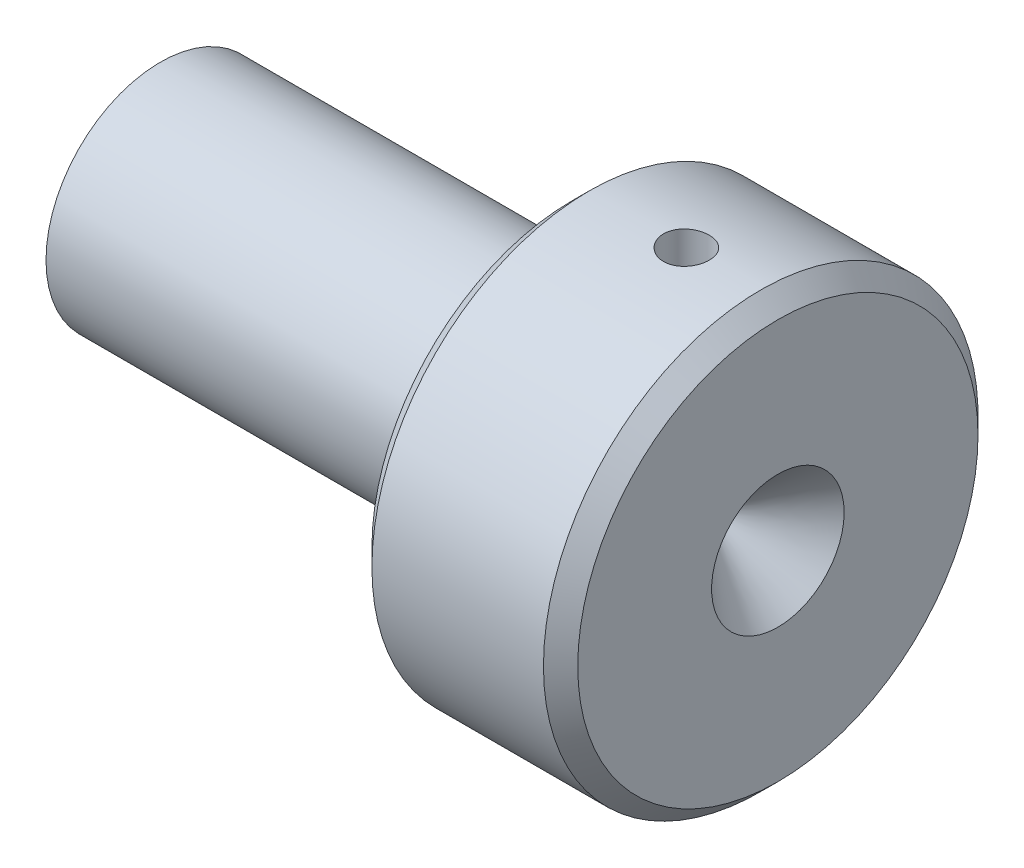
from build123d import *

# Parameters (mm, degrees)
CHANFREIN1_SIZE                   = 1.5
CHANFREIN2_SIZE                   = 5
CHANFREIN2_SIZE2                  = 4.795392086
DIAM_TRE_DU_PER_AGE_4_0_4_2_D     = 4
DIAM_TRE_DU_PER_AGE_4_0_4_2_DEPTH = 6
DIAM_TRE_DU_PER_AGE_4_0_4_2_TIP   = 1.201721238


with BuildPart() as part:
    # Esquisse1 → R_volution1 (revolve)
    with BuildSketch(Plane.XY, mode=Mode.PRIVATE) as r_volution1_sk:
        Polygon((0, 19), (0, 1), (-54, 3.357690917), (-54, 10), (-18, 10), (-18, 19), align=None)
    revolve(r_volution1_sk.sketch.rotate(Axis((-77.295062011, 0, 0), (1, 0, 0)), 90), axis=Axis((-77.295062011, 0, 0), (1, 0, 0)))

    # Chanfrein1
    chanfrein1_edges = [part.edges().sort_by_distance(p)[0] for p in [
        (0, 0, -19),
        (-18, 0, -19),
    ]]
    chamfer(chanfrein1_edges, length=CHANFREIN1_SIZE)

    # Chanfrein2
    chanfrein2_edges = [part.edges().sort_by_distance(p)[0] for p in [
        (0, 0, -1),
    ]]
    chanfrein2_side = [part.faces().sort_by_distance(p)[0] for p in [
        (-27, 0, -2.178845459),
    ]]
    chamfer(chanfrein2_edges, length=CHANFREIN2_SIZE, length2=CHANFREIN2_SIZE2, reference=chanfrein2_side[0])

    # Diam_tre du per_age _4.0 _4_2
    with Locations(Plane(origin=(0, 19, 0), x_dir=(-1, 0, 0), z_dir=(0, 1, 0))):
        with Locations((8, 0)):
            Hole(DIAM_TRE_DU_PER_AGE_4_0_4_2_D / 2, depth=DIAM_TRE_DU_PER_AGE_4_0_4_2_DEPTH)
            with Locations((0, 0, -(DIAM_TRE_DU_PER_AGE_4_0_4_2_DEPTH + DIAM_TRE_DU_PER_AGE_4_0_4_2_TIP / 2))):  # 118° drill point
                Cone(0, DIAM_TRE_DU_PER_AGE_4_0_4_2_D / 2, DIAM_TRE_DU_PER_AGE_4_0_4_2_TIP, mode=Mode.SUBTRACT)


solid = part.part
